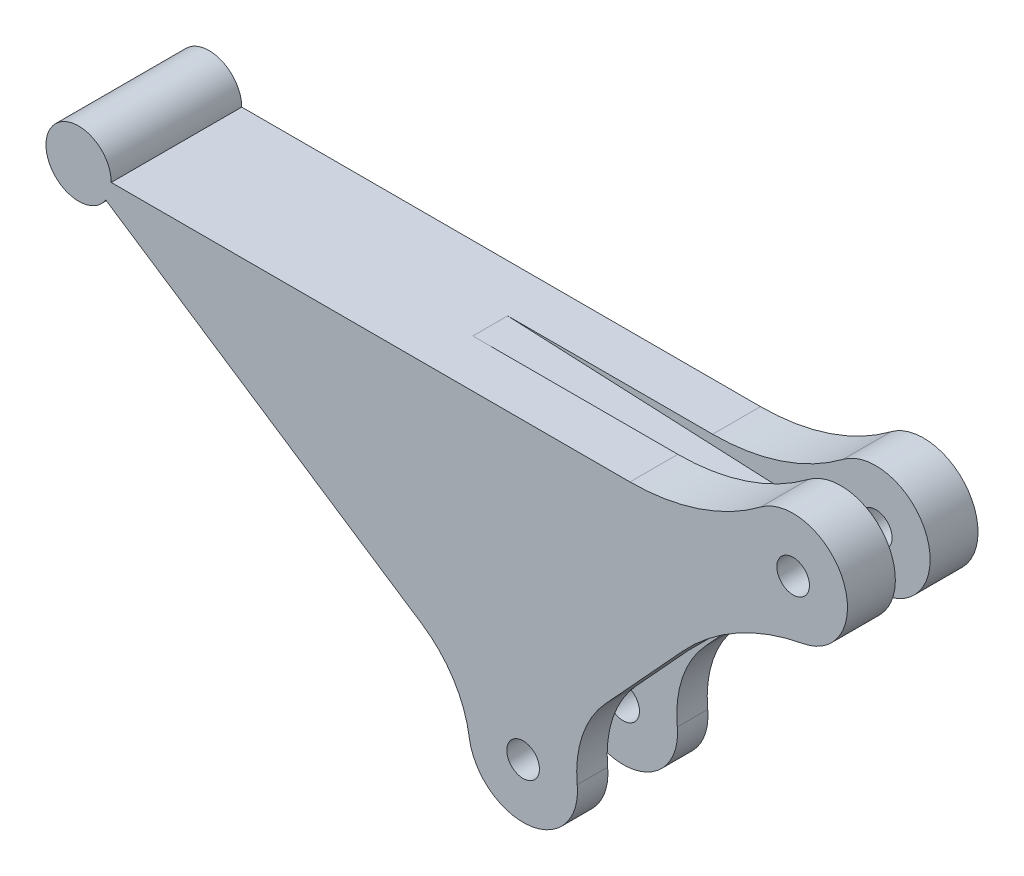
ISO-10303-21;
HEADER;
FILE_DESCRIPTION(('STEP AP214'),'2;1');
FILE_NAME('part.step','',(''),(''),'','','');
FILE_SCHEMA(('AUTOMOTIVE_DESIGN { 1 0 10303 214 1 1 1 1 }'));
ENDSEC;
DATA;
#1=APPLICATION_CONTEXT('core data for automotive mechanical design processes');
#2=APPLICATION_PROTOCOL_DEFINITION('international standard','automotive_design',2000,#1);
#3=PRODUCT_CONTEXT('',#1,'mechanical');
#4=PRODUCT('Part','Part','',(#3));
#5=PRODUCT_RELATED_PRODUCT_CATEGORY('part','',(#4));
#6=PRODUCT_DEFINITION_FORMATION('','',#4);
#7=PRODUCT_DEFINITION_CONTEXT('part definition',#1,'design');
#8=PRODUCT_DEFINITION('design','',#6,#7);
#9=PRODUCT_DEFINITION_SHAPE('','',#8);
#10=(LENGTH_UNIT() NAMED_UNIT(*) SI_UNIT(.MILLI.,.METRE.));
#11=(NAMED_UNIT(*) PLANE_ANGLE_UNIT() SI_UNIT($,.RADIAN.));
#12=(NAMED_UNIT(*) SI_UNIT($,.STERADIAN.) SOLID_ANGLE_UNIT());
#13=UNCERTAINTY_MEASURE_WITH_UNIT(LENGTH_MEASURE(1.E-05),#10,'distance_accuracy_value','');
#14=(GEOMETRIC_REPRESENTATION_CONTEXT(3) GLOBAL_UNCERTAINTY_ASSIGNED_CONTEXT((#13)) GLOBAL_UNIT_ASSIGNED_CONTEXT((#10,
#11,#12)) REPRESENTATION_CONTEXT('',''));
#15=CARTESIAN_POINT('',(0.,0.,0.));
#16=DIRECTION('',(0.,0.,1.));
#17=DIRECTION('',(1.,0.,0.));
#18=AXIS2_PLACEMENT_3D('',#15,#16,#17);
#19=CARTESIAN_POINT('',(-24.8278538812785,-27.0271654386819,12.));
#20=DIRECTION('',(0.,0.,-1.));
#21=DIRECTION('',(-1.,0.,0.));
#22=AXIS2_PLACEMENT_3D('',#19,#20,#21);
#23=CYLINDRICAL_SURFACE('',#22,5.);
#24=CARTESIAN_POINT('',(-24.8278538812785,-27.0271654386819,12.));
#25=DIRECTION('',(0.,0.,1.));
#26=DIRECTION('',(1.,0.,0.));
#27=AXIS2_PLACEMENT_3D('',#24,#25,#26);
#28=CIRCLE('',#27,5.);
#29=CARTESIAN_POINT('',(-29.7750385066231,-27.7519856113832,12.));
#30=VERTEX_POINT('',#29);
#31=CARTESIAN_POINT('',(-19.8518729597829,-26.5376617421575,12.));
#32=VERTEX_POINT('',#31);
#33=EDGE_CURVE('E285',#30,#32,#28,.T.);
#34=ORIENTED_EDGE('',*,*,#33,.F.);
#35=DIRECTION('',(0.,0.,-1.));
#36=VECTOR('',#35,1.);
#37=CARTESIAN_POINT('',(-29.7750385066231,-27.7519856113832,12.));
#38=LINE('',#37,#36);
#39=CARTESIAN_POINT('',(-29.7750385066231,-27.7519856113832,9.2));
#40=VERTEX_POINT('',#39);
#41=EDGE_CURVE('E370',#30,#40,#38,.T.);
#42=ORIENTED_EDGE('',*,*,#41,.T.);
#43=CARTESIAN_POINT('',(-24.8278538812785,-27.0271654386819,9.2));
#44=DIRECTION('',(0.,0.,-1.));
#45=DIRECTION('',(-1.,0.,0.));
#46=AXIS2_PLACEMENT_3D('',#43,#44,#45);
#47=CIRCLE('',#46,5.);
#48=CARTESIAN_POINT('',(-19.8518729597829,-26.5376617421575,9.2));
#49=VERTEX_POINT('',#48);
#50=EDGE_CURVE('E206',#49,#40,#47,.T.);
#51=ORIENTED_EDGE('',*,*,#50,.F.);
#52=DIRECTION('',(0.,0.,-1.));
#53=VECTOR('',#52,1.);
#54=CARTESIAN_POINT('',(-19.8518729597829,-26.5376617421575,12.));
#55=LINE('',#54,#53);
#56=EDGE_CURVE('E368',#49,#32,#55,.F.);
#57=ORIENTED_EDGE('',*,*,#56,.T.);
#58=EDGE_LOOP('',(#34,#42,#51,#57));
#59=FACE_BOUND('',#58,.T.);
#60=ADVANCED_FACE('F34',(#59),#23,.T.);
#61=CARTESIAN_POINT('',(0.,0.,12.));
#62=DIRECTION('',(0.736435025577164,-0.676508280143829,0.));
#63=DIRECTION('',(0.676508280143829,0.736435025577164,0.));
#64=AXIS2_PLACEMENT_3D('',#61,#62,#63);
#65=PLANE('',#64);
#66=DIRECTION('',(-0.676508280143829,-0.736435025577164,0.));
#67=VECTOR('',#66,1.);
#68=CARTESIAN_POINT('',(-12.4139269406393,-13.513582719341,2.8));
#69=LINE('',#68,#67);
#70=CARTESIAN_POINT('',(-12.4139269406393,-13.513582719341,2.8));
#71=VERTEX_POINT('',#70);
#72=CARTESIAN_POINT('',(-17.2642613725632,-18.7935715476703,2.8));
#73=VERTEX_POINT('',#72);
#74=EDGE_CURVE('E225',#71,#73,#69,.T.);
#75=ORIENTED_EDGE('',*,*,#74,.T.);
#76=DIRECTION('',(0.,0.,-1.));
#77=VECTOR('',#76,1.);
#78=CARTESIAN_POINT('',(-17.2642613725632,-18.7935715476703,12.));
#79=LINE('',#78,#77);
#80=CARTESIAN_POINT('',(-17.2642613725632,-18.7935715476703,0.));
#81=VERTEX_POINT('',#80);
#82=EDGE_CURVE('E373',#73,#81,#79,.T.);
#83=ORIENTED_EDGE('',*,*,#82,.T.);
#84=DIRECTION('',(-0.676508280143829,-0.736435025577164,0.));
#85=VECTOR('',#84,1.);
#86=CARTESIAN_POINT('',(0.,0.,0.));
#87=LINE('',#86,#85);
#88=CARTESIAN_POINT('',(-10.1476242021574,-11.0465253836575,0.));
#89=VERTEX_POINT('',#88);
#90=EDGE_CURVE('E308',#89,#81,#87,.T.);
#91=ORIENTED_EDGE('',*,*,#90,.F.);
#92=DIRECTION('',(0.,0.,-1.));
#93=VECTOR('',#92,1.);
#94=CARTESIAN_POINT('',(-10.1476242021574,-11.0465253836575,12.));
#95=LINE('',#94,#93);
#96=CARTESIAN_POINT('',(-10.1476242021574,-11.0465253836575,4.4));
#97=VERTEX_POINT('',#96);
#98=EDGE_CURVE('E339',#89,#97,#95,.F.);
#99=ORIENTED_EDGE('',*,*,#98,.T.);
#100=DIRECTION('',(-0.676508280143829,-0.736435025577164,0.));
#101=VECTOR('',#100,1.);
#102=CARTESIAN_POINT('',(-12.4139269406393,-13.513582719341,4.4));
#103=LINE('',#102,#101);
#104=CARTESIAN_POINT('',(-12.4139269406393,-13.513582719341,4.4));
#105=VERTEX_POINT('',#104);
#106=EDGE_CURVE('E261',#97,#105,#103,.T.);
#107=ORIENTED_EDGE('',*,*,#106,.T.);
#108=DIRECTION('',(0.,0.,1.));
#109=VECTOR('',#108,1.);
#110=CARTESIAN_POINT('',(-12.4139269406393,-13.513582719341,2.8));
#111=LINE('',#110,#109);
#112=EDGE_CURVE('E223',#71,#105,#111,.T.);
#113=ORIENTED_EDGE('',*,*,#112,.F.);
#114=EDGE_LOOP('',(#75,#83,#91,#99,#107,#113));
#115=FACE_BOUND('',#114,.T.);
#116=ADVANCED_FACE('F446',(#115),#65,.T.);
#117=DIRECTION('',(-0.676508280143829,-0.736435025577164,0.));
#118=VECTOR('',#117,1.);
#119=CARTESIAN_POINT('',(0.,0.,12.));
#120=LINE('',#119,#118);
#121=CARTESIAN_POINT('',(-10.1476242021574,-11.0465253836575,12.));
#122=VERTEX_POINT('',#121);
#123=CARTESIAN_POINT('',(-17.2642613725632,-18.7935715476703,12.));
#124=VERTEX_POINT('',#123);
#125=EDGE_CURVE('E287',#122,#124,#120,.T.);
#126=ORIENTED_EDGE('',*,*,#125,.T.);
#127=DIRECTION('',(0.,0.,-1.));
#128=VECTOR('',#127,1.);
#129=CARTESIAN_POINT('',(-17.2642613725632,-18.7935715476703,12.));
#130=LINE('',#129,#128);
#131=CARTESIAN_POINT('',(-17.2642613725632,-18.7935715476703,9.2));
#132=VERTEX_POINT('',#131);
#133=EDGE_CURVE('E376',#124,#132,#130,.T.);
#134=ORIENTED_EDGE('',*,*,#133,.T.);
#135=DIRECTION('',(-0.676508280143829,-0.736435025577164,0.));
#136=VECTOR('',#135,1.);
#137=CARTESIAN_POINT('',(-12.4139269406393,-13.513582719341,9.2));
#138=LINE('',#137,#136);
#139=CARTESIAN_POINT('',(-12.4139269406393,-13.513582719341,9.2));
#140=VERTEX_POINT('',#139);
#141=EDGE_CURVE('E391',#140,#132,#138,.T.);
#142=ORIENTED_EDGE('',*,*,#141,.F.);
#143=CARTESIAN_POINT('',(-12.4139269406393,-13.513582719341,7.6));
#144=VERTEX_POINT('',#143);
#145=EDGE_CURVE('E220',#144,#140,#111,.T.);
#146=ORIENTED_EDGE('',*,*,#145,.F.);
#147=DIRECTION('',(-0.676508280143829,-0.736435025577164,0.));
#148=VECTOR('',#147,1.);
#149=CARTESIAN_POINT('',(-12.4139269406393,-13.513582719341,7.6));
#150=LINE('',#149,#148);
#151=CARTESIAN_POINT('',(-10.1476242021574,-11.0465253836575,7.6));
#152=VERTEX_POINT('',#151);
#153=EDGE_CURVE('E245',#152,#144,#150,.T.);
#154=ORIENTED_EDGE('',*,*,#153,.F.);
#155=DIRECTION('',(0.,0.,-1.));
#156=VECTOR('',#155,1.);
#157=CARTESIAN_POINT('',(-10.1476242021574,-11.0465253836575,12.));
#158=LINE('',#157,#156);
#159=EDGE_CURVE('E341',#152,#122,#158,.F.);
#160=ORIENTED_EDGE('',*,*,#159,.T.);
#161=EDGE_LOOP('',(#126,#134,#142,#146,#154,#160));
#162=FACE_BOUND('',#161,.T.);
#163=ADVANCED_FACE('F397',(#162),#65,.T.);
#164=CARTESIAN_POINT('',(-24.8278538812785,-27.0271654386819,12.));
#165=DIRECTION('',(0.,0.,-1.));
#166=DIRECTION('',(-1.,0.,0.));
#167=AXIS2_PLACEMENT_3D('',#164,#165,#166);
#168=CYLINDRICAL_SURFACE('',#167,1.5);
#169=CARTESIAN_POINT('',(-24.8278538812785,-27.0271654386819,12.));
#170=DIRECTION('',(0.,0.,1.));
#171=DIRECTION('',(1.,0.,0.));
#172=AXIS2_PLACEMENT_3D('',#169,#170,#171);
#173=CIRCLE('',#172,1.5);
#174=CARTESIAN_POINT('',(-23.3278538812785,-27.0271654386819,12.));
#175=VERTEX_POINT('',#174);
#176=EDGE_CURVE('E271',#175,#175,#173,.T.);
#177=ORIENTED_EDGE('',*,*,#176,.T.);
#178=EDGE_LOOP('',(#177));
#179=FACE_BOUND('',#178,.T.);
#180=CARTESIAN_POINT('',(-24.8278538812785,-27.0271654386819,9.2));
#181=DIRECTION('',(0.,0.,-1.));
#182=DIRECTION('',(-1.,0.,0.));
#183=AXIS2_PLACEMENT_3D('',#180,#181,#182);
#184=CIRCLE('',#183,1.5);
#185=CARTESIAN_POINT('',(-26.3278538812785,-27.0271654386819,9.2));
#186=VERTEX_POINT('',#185);
#187=EDGE_CURVE('E319',#186,#186,#184,.T.);
#188=ORIENTED_EDGE('',*,*,#187,.T.);
#189=EDGE_LOOP('',(#188));
#190=FACE_BOUND('',#189,.T.);
#191=ADVANCED_FACE('F465',(#179,#190),#168,.F.);
#192=CARTESIAN_POINT('',(0.,0.,12.));
#193=DIRECTION('',(0.,0.,-1.));
#194=DIRECTION('',(-1.,0.,0.));
#195=AXIS2_PLACEMENT_3D('',#192,#193,#194);
#196=CYLINDRICAL_SURFACE('',#195,5.);
#197=CARTESIAN_POINT('',(0.,0.,7.6));
#198=DIRECTION('',(0.,0.,-1.));
#199=DIRECTION('',(-1.,0.,0.));
#200=AXIS2_PLACEMENT_3D('',#197,#198,#199);
#201=CIRCLE('',#200,5.);
#202=CARTESIAN_POINT('',(-3.,4.,7.6));
#203=VERTEX_POINT('',#202);
#204=CARTESIAN_POINT('',(0.916215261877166,-4.91533819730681,7.6));
#205=VERTEX_POINT('',#204);
#206=EDGE_CURVE('E242',#203,#205,#201,.T.);
#207=ORIENTED_EDGE('',*,*,#206,.F.);
#208=DIRECTION('',(0.,0.,-1.));
#209=VECTOR('',#208,1.);
#210=CARTESIAN_POINT('',(-3.,4.,12.));
#211=LINE('',#210,#209);
#212=CARTESIAN_POINT('',(-3.,4.,12.));
#213=VERTEX_POINT('',#212);
#214=EDGE_CURVE('E337',#203,#213,#211,.F.);
#215=ORIENTED_EDGE('',*,*,#214,.T.);
#216=CARTESIAN_POINT('',(0.,0.,12.));
#217=DIRECTION('',(0.,0.,1.));
#218=DIRECTION('',(1.,0.,0.));
#219=AXIS2_PLACEMENT_3D('',#216,#217,#218);
#220=CIRCLE('',#219,5.);
#221=CARTESIAN_POINT('',(0.916215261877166,-4.91533819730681,12.));
#222=VERTEX_POINT('',#221);
#223=EDGE_CURVE('E274',#222,#213,#220,.T.);
#224=ORIENTED_EDGE('',*,*,#223,.F.);
#225=DIRECTION('',(0.,0.,-1.));
#226=VECTOR('',#225,1.);
#227=CARTESIAN_POINT('',(0.916215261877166,-4.91533819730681,12.));
#228=LINE('',#227,#226);
#229=EDGE_CURVE('E334',#222,#205,#228,.T.);
#230=ORIENTED_EDGE('',*,*,#229,.T.);
#231=EDGE_LOOP('',(#207,#215,#224,#230));
#232=FACE_BOUND('',#231,.T.);
#233=ADVANCED_FACE('F410',(#232),#196,.T.);
#234=CARTESIAN_POINT('',(0.,0.,12.));
#235=DIRECTION('',(0.,0.,-1.));
#236=DIRECTION('',(-1.,0.,0.));
#237=AXIS2_PLACEMENT_3D('',#234,#235,#236);
#238=CYLINDRICAL_SURFACE('',#237,1.5);
#239=CARTESIAN_POINT('',(0.,0.,12.));
#240=DIRECTION('',(0.,0.,1.));
#241=DIRECTION('',(1.,0.,0.));
#242=AXIS2_PLACEMENT_3D('',#239,#240,#241);
#243=CIRCLE('',#242,1.5);
#244=CARTESIAN_POINT('',(1.5,0.,12.));
#245=VERTEX_POINT('',#244);
#246=EDGE_CURVE('E289',#245,#245,#243,.T.);
#247=ORIENTED_EDGE('',*,*,#246,.T.);
#248=EDGE_LOOP('',(#247));
#249=FACE_BOUND('',#248,.T.);
#250=CARTESIAN_POINT('',(0.,0.,7.6));
#251=DIRECTION('',(0.,0.,-1.));
#252=DIRECTION('',(-1.,0.,0.));
#253=AXIS2_PLACEMENT_3D('',#250,#251,#252);
#254=CIRCLE('',#253,1.5);
#255=CARTESIAN_POINT('',(-1.5,0.,7.6));
#256=VERTEX_POINT('',#255);
#257=EDGE_CURVE('E229',#256,#256,#254,.T.);
#258=ORIENTED_EDGE('',*,*,#257,.T.);
#259=EDGE_LOOP('',(#258));
#260=FACE_BOUND('',#259,.T.);
#261=ADVANCED_FACE('F538',(#249,#260),#238,.F.);
#262=CARTESIAN_POINT('',(0.,0.,0.));
#263=DIRECTION('',(0.,0.,1.));
#264=DIRECTION('',(1.,0.,0.));
#265=AXIS2_PLACEMENT_3D('',#262,#263,#264);
#266=CIRCLE('',#265,5.);
#267=CARTESIAN_POINT('',(0.916215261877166,-4.91533819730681,0.));
#268=VERTEX_POINT('',#267);
#269=CARTESIAN_POINT('',(-3.,4.,0.));
#270=VERTEX_POINT('',#269);
#271=EDGE_CURVE('E295',#268,#270,#266,.T.);
#272=ORIENTED_EDGE('',*,*,#271,.T.);
#273=DIRECTION('',(0.,0.,-1.));
#274=VECTOR('',#273,1.);
#275=CARTESIAN_POINT('',(-3.,4.,12.));
#276=LINE('',#275,#274);
#277=CARTESIAN_POINT('',(-3.,4.,4.4));
#278=VERTEX_POINT('',#277);
#279=EDGE_CURVE('E332',#270,#278,#276,.F.);
#280=ORIENTED_EDGE('',*,*,#279,.T.);
#281=CARTESIAN_POINT('',(0.,0.,4.4));
#282=DIRECTION('',(0.,0.,-1.));
#283=DIRECTION('',(-1.,0.,0.));
#284=AXIS2_PLACEMENT_3D('',#281,#282,#283);
#285=CIRCLE('',#284,5.);
#286=CARTESIAN_POINT('',(0.916215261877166,-4.91533819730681,4.4));
#287=VERTEX_POINT('',#286);
#288=EDGE_CURVE('E258',#278,#287,#285,.T.);
#289=ORIENTED_EDGE('',*,*,#288,.T.);
#290=DIRECTION('',(0.,0.,-1.));
#291=VECTOR('',#290,1.);
#292=CARTESIAN_POINT('',(0.916215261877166,-4.91533819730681,12.));
#293=LINE('',#292,#291);
#294=EDGE_CURVE('E329',#287,#268,#293,.T.);
#295=ORIENTED_EDGE('',*,*,#294,.T.);
#296=EDGE_LOOP('',(#272,#280,#289,#295));
#297=FACE_BOUND('',#296,.T.);
#298=ADVANCED_FACE('F519',(#297),#196,.T.);
#299=CARTESIAN_POINT('',(0.,0.,12.));
#300=DIRECTION('',(0.,-1.,0.));
#301=DIRECTION('',(1.,0.,0.));
#302=AXIS2_PLACEMENT_3D('',#299,#300,#301);
#303=PLANE('',#302);
#304=DIRECTION('',(1.,0.,0.));
#305=VECTOR('',#304,1.);
#306=CARTESIAN_POINT('',(-5.,0.,4.4));
#307=LINE('',#306,#305);
#308=CARTESIAN_POINT('',(-33.85,0.,4.4));
#309=VERTEX_POINT('',#308);
#310=CARTESIAN_POINT('',(-15.,0.,4.4));
#311=VERTEX_POINT('',#310);
#312=EDGE_CURVE('E255',#309,#311,#307,.T.);
#313=ORIENTED_EDGE('',*,*,#312,.T.);
#314=DIRECTION('',(0.,0.,1.));
#315=VECTOR('',#314,1.);
#316=CARTESIAN_POINT('',(-15.,0.,0.));
#317=LINE('',#316,#315);
#318=CARTESIAN_POINT('',(-15.,0.,0.));
#319=VERTEX_POINT('',#318);
#320=EDGE_CURVE('E326',#311,#319,#317,.F.);
#321=ORIENTED_EDGE('',*,*,#320,.T.);
#322=DIRECTION('',(-1.,0.,0.));
#323=VECTOR('',#322,1.);
#324=CARTESIAN_POINT('',(0.,0.,0.));
#325=LINE('',#324,#323);
#326=CARTESIAN_POINT('',(-62.7,0.,0.));
#327=VERTEX_POINT('',#326);
#328=EDGE_CURVE('E298',#319,#327,#325,.T.);
#329=ORIENTED_EDGE('',*,*,#328,.T.);
#330=DIRECTION('',(0.,0.,-1.));
#331=VECTOR('',#330,1.);
#332=CARTESIAN_POINT('',(-62.7,0.,12.));
#333=LINE('',#332,#331);
#334=CARTESIAN_POINT('',(-62.7,0.,12.));
#335=VERTEX_POINT('',#334);
#336=EDGE_CURVE('E315',#335,#327,#333,.T.);
#337=ORIENTED_EDGE('',*,*,#336,.F.);
#338=DIRECTION('',(-1.,0.,0.));
#339=VECTOR('',#338,1.);
#340=CARTESIAN_POINT('',(0.,0.,12.));
#341=LINE('',#340,#339);
#342=CARTESIAN_POINT('',(-15.,0.,12.));
#343=VERTEX_POINT('',#342);
#344=EDGE_CURVE('E278',#343,#335,#341,.T.);
#345=ORIENTED_EDGE('',*,*,#344,.F.);
#346=DIRECTION('',(0.,0.,1.));
#347=VECTOR('',#346,1.);
#348=CARTESIAN_POINT('',(-15.,0.,7.6));
#349=LINE('',#348,#347);
#350=CARTESIAN_POINT('',(-15.,0.,7.6));
#351=VERTEX_POINT('',#350);
#352=EDGE_CURVE('E318',#343,#351,#349,.F.);
#353=ORIENTED_EDGE('',*,*,#352,.T.);
#354=DIRECTION('',(1.,0.,0.));
#355=VECTOR('',#354,1.);
#356=CARTESIAN_POINT('',(-5.,0.,7.6));
#357=LINE('',#356,#355);
#358=CARTESIAN_POINT('',(-33.85,0.,7.6));
#359=VERTEX_POINT('',#358);
#360=EDGE_CURVE('E239',#359,#351,#357,.T.);
#361=ORIENTED_EDGE('',*,*,#360,.F.);
#362=DIRECTION('',(0.,0.,1.));
#363=VECTOR('',#362,1.);
#364=CARTESIAN_POINT('',(-33.85,0.,4.4));
#365=LINE('',#364,#363);
#366=EDGE_CURVE('E266',#309,#359,#365,.T.);
#367=ORIENTED_EDGE('',*,*,#366,.F.);
#368=EDGE_LOOP('',(#313,#321,#329,#337,#345,#353,#361,#367));
#369=FACE_BOUND('',#368,.T.);
#370=ADVANCED_FACE('F421',(#369),#303,.F.);
#371=CARTESIAN_POINT('',(-65.7,0.,12.));
#372=DIRECTION('',(0.,0.,-1.));
#373=DIRECTION('',(-1.,0.,0.));
#374=AXIS2_PLACEMENT_3D('',#371,#372,#373);
#375=CYLINDRICAL_SURFACE('',#374,3.00000000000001);
#376=CARTESIAN_POINT('',(-65.7,0.,0.));
#377=DIRECTION('',(0.,0.,1.));
#378=DIRECTION('',(1.,0.,0.));
#379=AXIS2_PLACEMENT_3D('',#376,#377,#378);
#380=CIRCLE('',#379,3.00000000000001);
#381=CARTESIAN_POINT('',(-63.1976237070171,-1.65472441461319,0.));
#382=VERTEX_POINT('',#381);
#383=EDGE_CURVE('E300',#327,#382,#380,.T.);
#384=ORIENTED_EDGE('',*,*,#383,.T.);
#385=DIRECTION('',(0.,0.,-1.));
#386=VECTOR('',#385,1.);
#387=CARTESIAN_POINT('',(-63.1976237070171,-1.65472441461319,12.));
#388=LINE('',#387,#386);
#389=CARTESIAN_POINT('',(-63.1976237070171,-1.65472441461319,12.));
#390=VERTEX_POINT('',#389);
#391=EDGE_CURVE('E292',#390,#382,#388,.T.);
#392=ORIENTED_EDGE('',*,*,#391,.F.);
#393=CARTESIAN_POINT('',(-65.7,0.,12.));
#394=DIRECTION('',(0.,0.,1.));
#395=DIRECTION('',(1.,0.,0.));
#396=AXIS2_PLACEMENT_3D('',#393,#394,#395);
#397=CIRCLE('',#396,3.00000000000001);
#398=EDGE_CURVE('E280',#335,#390,#397,.T.);
#399=ORIENTED_EDGE('',*,*,#398,.F.);
#400=ORIENTED_EDGE('',*,*,#336,.T.);
#401=EDGE_LOOP('',(#384,#392,#399,#400));
#402=FACE_BOUND('',#401,.T.);
#403=ADVANCED_FACE('F429',(#402),#375,.T.);
#404=CARTESIAN_POINT('',(-19.9882240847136,-30.2274249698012,12.));
#405=DIRECTION('',(-0.551574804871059,-0.834125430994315,0.));
#406=DIRECTION('',(0.834125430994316,-0.55157480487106,0.));
#407=AXIS2_PLACEMENT_3D('',#404,#405,#406);
#408=PLANE('',#407);
#409=DIRECTION('',(-0.834125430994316,0.55157480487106,0.));
#410=VECTOR('',#409,1.);
#411=CARTESIAN_POINT('',(-19.9882240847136,-30.2274249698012,0.));
#412=LINE('',#411,#410);
#413=CARTESIAN_POINT('',(-34.1536597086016,-20.8603716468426,0.));
#414=VERTEX_POINT('',#413);
#415=EDGE_CURVE('E303',#414,#382,#412,.T.);
#416=ORIENTED_EDGE('',*,*,#415,.F.);
#417=DIRECTION('',(0.,0.,-1.));
#418=VECTOR('',#417,1.);
#419=CARTESIAN_POINT('',(-34.1536597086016,-20.8603716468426,12.));
#420=LINE('',#419,#418);
#421=CARTESIAN_POINT('',(-34.1536597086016,-20.8603716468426,2.8));
#422=VERTEX_POINT('',#421);
#423=EDGE_CURVE('E366',#414,#422,#420,.F.);
#424=ORIENTED_EDGE('',*,*,#423,.T.);
#425=DIRECTION('',(-0.834125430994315,0.55157480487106,0.));
#426=VECTOR('',#425,1.);
#427=CARTESIAN_POINT('',(-28.9984810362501,-24.2692914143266,2.8));
#428=LINE('',#427,#426);
#429=CARTESIAN_POINT('',(-46.0980523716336,-12.9620079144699,2.8));
#430=VERTEX_POINT('',#429);
#431=EDGE_CURVE('E219',#422,#430,#428,.T.);
#432=ORIENTED_EDGE('',*,*,#431,.T.);
#433=DIRECTION('',(0.,0.,1.));
#434=VECTOR('',#433,1.);
#435=CARTESIAN_POINT('',(-46.0980523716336,-12.9620079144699,2.8));
#436=LINE('',#435,#434);
#437=CARTESIAN_POINT('',(-46.0980523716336,-12.9620079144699,9.2));
#438=VERTEX_POINT('',#437);
#439=EDGE_CURVE('E212',#430,#438,#436,.T.);
#440=ORIENTED_EDGE('',*,*,#439,.T.);
#441=DIRECTION('',(-0.834125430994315,0.55157480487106,0.));
#442=VECTOR('',#441,1.);
#443=CARTESIAN_POINT('',(-28.9984810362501,-24.2692914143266,9.2));
#444=LINE('',#443,#442);
#445=CARTESIAN_POINT('',(-34.1536597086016,-20.8603716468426,9.2));
#446=VERTEX_POINT('',#445);
#447=EDGE_CURVE('E195',#446,#438,#444,.T.);
#448=ORIENTED_EDGE('',*,*,#447,.F.);
#449=DIRECTION('',(0.,0.,-1.));
#450=VECTOR('',#449,1.);
#451=CARTESIAN_POINT('',(-34.1536597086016,-20.8603716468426,12.));
#452=LINE('',#451,#450);
#453=CARTESIAN_POINT('',(-34.1536597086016,-20.8603716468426,12.));
#454=VERTEX_POINT('',#453);
#455=EDGE_CURVE('E364',#446,#454,#452,.F.);
#456=ORIENTED_EDGE('',*,*,#455,.T.);
#457=DIRECTION('',(-0.834125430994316,0.55157480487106,0.));
#458=VECTOR('',#457,1.);
#459=CARTESIAN_POINT('',(-19.9882240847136,-30.2274249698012,12.));
#460=LINE('',#459,#458);
#461=EDGE_CURVE('E283',#454,#390,#460,.T.);
#462=ORIENTED_EDGE('',*,*,#461,.T.);
#463=ORIENTED_EDGE('',*,*,#391,.T.);
#464=EDGE_LOOP('',(#416,#424,#432,#440,#448,#456,#462,#463));
#465=FACE_BOUND('',#464,.T.);
#466=ADVANCED_FACE('F217',(#465),#408,.T.);
#467=CARTESIAN_POINT('',(-24.8278538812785,-27.0271654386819,2.8));
#468=DIRECTION('',(0.,0.,-1.));
#469=DIRECTION('',(-1.,0.,0.));
#470=AXIS2_PLACEMENT_3D('',#467,#468,#469);
#471=CIRCLE('',#470,5.);
#472=CARTESIAN_POINT('',(-19.8518729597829,-26.5376617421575,2.8));
#473=VERTEX_POINT('',#472);
#474=CARTESIAN_POINT('',(-29.7750385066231,-27.7519856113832,2.8));
#475=VERTEX_POINT('',#474);
#476=EDGE_CURVE('E468',#473,#475,#471,.T.);
#477=ORIENTED_EDGE('',*,*,#476,.T.);
#478=DIRECTION('',(0.,0.,-1.));
#479=VECTOR('',#478,1.);
#480=CARTESIAN_POINT('',(-29.7750385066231,-27.7519856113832,12.));
#481=LINE('',#480,#479);
#482=CARTESIAN_POINT('',(-29.7750385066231,-27.7519856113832,0.));
#483=VERTEX_POINT('',#482);
#484=EDGE_CURVE('E361',#475,#483,#481,.T.);
#485=ORIENTED_EDGE('',*,*,#484,.T.);
#486=CARTESIAN_POINT('',(-24.8278538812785,-27.0271654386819,0.));
#487=DIRECTION('',(0.,0.,1.));
#488=DIRECTION('',(1.,0.,0.));
#489=AXIS2_PLACEMENT_3D('',#486,#487,#488);
#490=CIRCLE('',#489,5.);
#491=CARTESIAN_POINT('',(-19.8518729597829,-26.5376617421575,0.));
#492=VERTEX_POINT('',#491);
#493=EDGE_CURVE('E305',#483,#492,#490,.T.);
#494=ORIENTED_EDGE('',*,*,#493,.T.);
#495=DIRECTION('',(0.,0.,-1.));
#496=VECTOR('',#495,1.);
#497=CARTESIAN_POINT('',(-19.8518729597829,-26.5376617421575,12.));
#498=LINE('',#497,#496);
#499=EDGE_CURVE('E359',#492,#473,#498,.F.);
#500=ORIENTED_EDGE('',*,*,#499,.T.);
#501=EDGE_LOOP('',(#477,#485,#494,#500));
#502=FACE_BOUND('',#501,.T.);
#503=ADVANCED_FACE('F448',(#502),#23,.T.);
#504=CARTESIAN_POINT('',(-24.8278538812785,-27.0271654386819,2.8));
#505=DIRECTION('',(0.,0.,-1.));
#506=DIRECTION('',(-1.,0.,0.));
#507=AXIS2_PLACEMENT_3D('',#504,#505,#506);
#508=CIRCLE('',#507,1.5);
#509=CARTESIAN_POINT('',(-26.3278538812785,-27.0271654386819,2.8));
#510=VERTEX_POINT('',#509);
#511=EDGE_CURVE('E233',#510,#510,#508,.T.);
#512=ORIENTED_EDGE('',*,*,#511,.F.);
#513=EDGE_LOOP('',(#512));
#514=FACE_BOUND('',#513,.T.);
#515=CARTESIAN_POINT('',(-24.8278538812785,-27.0271654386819,0.));
#516=DIRECTION('',(0.,0.,1.));
#517=DIRECTION('',(1.,0.,0.));
#518=AXIS2_PLACEMENT_3D('',#515,#516,#517);
#519=CIRCLE('',#518,1.5);
#520=CARTESIAN_POINT('',(-23.3278538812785,-27.0271654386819,0.));
#521=VERTEX_POINT('',#520);
#522=EDGE_CURVE('E270',#521,#521,#519,.T.);
#523=ORIENTED_EDGE('',*,*,#522,.F.);
#524=EDGE_LOOP('',(#523));
#525=FACE_BOUND('',#524,.T.);
#526=ADVANCED_FACE('F456',(#514,#525),#168,.F.);
#527=CARTESIAN_POINT('',(0.,0.,4.4));
#528=DIRECTION('',(0.,0.,-1.));
#529=DIRECTION('',(-1.,0.,0.));
#530=AXIS2_PLACEMENT_3D('',#527,#528,#529);
#531=CIRCLE('',#530,1.5);
#532=CARTESIAN_POINT('',(-1.5,0.,4.4));
#533=VERTEX_POINT('',#532);
#534=EDGE_CURVE('E247',#533,#533,#531,.T.);
#535=ORIENTED_EDGE('',*,*,#534,.F.);
#536=EDGE_LOOP('',(#535));
#537=FACE_BOUND('',#536,.T.);
#538=CARTESIAN_POINT('',(0.,0.,0.));
#539=DIRECTION('',(0.,0.,1.));
#540=DIRECTION('',(1.,0.,0.));
#541=AXIS2_PLACEMENT_3D('',#538,#539,#540);
#542=CIRCLE('',#541,1.5);
#543=CARTESIAN_POINT('',(1.5,0.,0.));
#544=VERTEX_POINT('',#543);
#545=EDGE_CURVE('E275',#544,#544,#542,.T.);
#546=ORIENTED_EDGE('',*,*,#545,.F.);
#547=EDGE_LOOP('',(#546));
#548=FACE_BOUND('',#547,.T.);
#549=ADVANCED_FACE('F462',(#537,#548),#238,.F.);
#550=CARTESIAN_POINT('',(0.,0.,12.));
#551=DIRECTION('',(0.,0.,1.));
#552=DIRECTION('',(1.,0.,0.));
#553=AXIS2_PLACEMENT_3D('',#550,#551,#552);
#554=PLANE('',#553);
#555=ORIENTED_EDGE('',*,*,#176,.F.);
#556=EDGE_LOOP('',(#555));
#557=FACE_BOUND('',#556,.T.);
#558=ORIENTED_EDGE('',*,*,#125,.F.);
#559=CARTESIAN_POINT('',(4.58107630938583,-24.576690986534,12.));
#560=DIRECTION('',(0.,0.,1.));
#561=DIRECTION('',(1.,0.,0.));
#562=AXIS2_PLACEMENT_3D('',#559,#560,#561);
#563=CIRCLE('',#562,20.);
#564=EDGE_CURVE('E357',#122,#222,#563,.F.);
#565=ORIENTED_EDGE('',*,*,#564,.T.);
#566=ORIENTED_EDGE('',*,*,#223,.T.);
#567=CARTESIAN_POINT('',(-15.,20.,12.));
#568=DIRECTION('',(0.,0.,1.));
#569=DIRECTION('',(1.,0.,0.));
#570=AXIS2_PLACEMENT_3D('',#567,#568,#569);
#571=CIRCLE('',#570,20.);
#572=EDGE_CURVE('E349',#213,#343,#571,.F.);
#573=ORIENTED_EDGE('',*,*,#572,.T.);
#574=ORIENTED_EDGE('',*,*,#344,.T.);
#575=ORIENTED_EDGE('',*,*,#398,.T.);
#576=ORIENTED_EDGE('',*,*,#461,.F.);
#577=CARTESIAN_POINT('',(-39.6694077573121,-29.2016259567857,12.));
#578=DIRECTION('',(0.,0.,1.));
#579=DIRECTION('',(1.,0.,0.));
#580=AXIS2_PLACEMENT_3D('',#577,#578,#579);
#581=CIRCLE('',#580,10.);
#582=EDGE_CURVE('E383',#454,#30,#581,.F.);
#583=ORIENTED_EDGE('',*,*,#582,.T.);
#584=ORIENTED_EDGE('',*,*,#33,.T.);
#585=CARTESIAN_POINT('',(-9.89991111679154,-25.5586543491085,12.));
#586=DIRECTION('',(0.,0.,1.));
#587=DIRECTION('',(1.,0.,0.));
#588=AXIS2_PLACEMENT_3D('',#585,#586,#587);
#589=CIRCLE('',#588,10.);
#590=EDGE_CURVE('E11',#32,#124,#589,.F.);
#591=ORIENTED_EDGE('',*,*,#590,.T.);
#592=EDGE_LOOP('',(#558,#565,#566,#573,#574,#575,#576,#583,#584,#591));
#593=FACE_BOUND('',#592,.T.);
#594=ORIENTED_EDGE('',*,*,#246,.F.);
#595=EDGE_LOOP('',(#594));
#596=FACE_BOUND('',#595,.T.);
#597=ADVANCED_FACE('F402',(#557,#593,#596),#554,.T.);
#598=CARTESIAN_POINT('',(0.,0.,0.));
#599=DIRECTION('',(0.,0.,1.));
#600=DIRECTION('',(1.,0.,0.));
#601=AXIS2_PLACEMENT_3D('',#598,#599,#600);
#602=PLANE('',#601);
#603=ORIENTED_EDGE('',*,*,#522,.T.);
#604=EDGE_LOOP('',(#603));
#605=FACE_BOUND('',#604,.T.);
#606=ORIENTED_EDGE('',*,*,#271,.F.);
#607=CARTESIAN_POINT('',(4.58107630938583,-24.576690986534,0.));
#608=DIRECTION('',(0.,0.,1.));
#609=DIRECTION('',(1.,0.,0.));
#610=AXIS2_PLACEMENT_3D('',#607,#608,#609);
#611=CIRCLE('',#610,20.);
#612=EDGE_CURVE('E351',#268,#89,#611,.T.);
#613=ORIENTED_EDGE('',*,*,#612,.T.);
#614=ORIENTED_EDGE('',*,*,#90,.T.);
#615=CARTESIAN_POINT('',(-9.89991111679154,-25.5586543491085,0.));
#616=DIRECTION('',(0.,0.,1.));
#617=DIRECTION('',(1.,0.,0.));
#618=AXIS2_PLACEMENT_3D('',#615,#616,#617);
#619=CIRCLE('',#618,10.);
#620=EDGE_CURVE('E385',#81,#492,#619,.T.);
#621=ORIENTED_EDGE('',*,*,#620,.T.);
#622=ORIENTED_EDGE('',*,*,#493,.F.);
#623=CARTESIAN_POINT('',(-39.6694077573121,-29.2016259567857,0.));
#624=DIRECTION('',(0.,0.,1.));
#625=DIRECTION('',(1.,0.,0.));
#626=AXIS2_PLACEMENT_3D('',#623,#624,#625);
#627=CIRCLE('',#626,10.);
#628=EDGE_CURVE('E378',#483,#414,#627,.T.);
#629=ORIENTED_EDGE('',*,*,#628,.T.);
#630=ORIENTED_EDGE('',*,*,#415,.T.);
#631=ORIENTED_EDGE('',*,*,#383,.F.);
#632=ORIENTED_EDGE('',*,*,#328,.F.);
#633=CARTESIAN_POINT('',(-15.,20.,0.));
#634=DIRECTION('',(0.,0.,1.));
#635=DIRECTION('',(1.,0.,0.));
#636=AXIS2_PLACEMENT_3D('',#633,#634,#635);
#637=CIRCLE('',#636,20.);
#638=EDGE_CURVE('E343',#319,#270,#637,.T.);
#639=ORIENTED_EDGE('',*,*,#638,.T.);
#640=EDGE_LOOP('',(#606,#613,#614,#621,#622,#629,#630,#631,#632,#639));
#641=FACE_BOUND('',#640,.T.);
#642=ORIENTED_EDGE('',*,*,#545,.T.);
#643=EDGE_LOOP('',(#642));
#644=FACE_BOUND('',#643,.T.);
#645=ADVANCED_FACE('F478',(#605,#641,#644),#602,.F.);
#646=CARTESIAN_POINT('',(0.,0.,4.4));
#647=DIRECTION('',(0.,0.,-1.));
#648=DIRECTION('',(-1.,0.,0.));
#649=AXIS2_PLACEMENT_3D('',#646,#647,#648);
#650=PLANE('',#649);
#651=DIRECTION('',(0.530023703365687,0.847982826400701,0.));
#652=VECTOR('',#651,1.);
#653=CARTESIAN_POINT('',(-4.8133382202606,-1.35343089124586,4.4));
#654=LINE('',#653,#652);
#655=CARTESIAN_POINT('',(-4.8133382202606,-1.35343089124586,4.4));
#656=VERTEX_POINT('',#655);
#657=EDGE_CURVE('E250',#105,#656,#654,.T.);
#658=ORIENTED_EDGE('',*,*,#657,.F.);
#659=ORIENTED_EDGE('',*,*,#106,.F.);
#660=CARTESIAN_POINT('',(4.58107630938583,-24.576690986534,4.4));
#661=DIRECTION('',(0.,0.,-1.));
#662=DIRECTION('',(-1.,0.,0.));
#663=AXIS2_PLACEMENT_3D('',#660,#661,#662);
#664=CIRCLE('',#663,20.);
#665=EDGE_CURVE('E353',#97,#287,#664,.T.);
#666=ORIENTED_EDGE('',*,*,#665,.T.);
#667=ORIENTED_EDGE('',*,*,#288,.F.);
#668=CARTESIAN_POINT('',(-15.,20.,4.4));
#669=DIRECTION('',(0.,0.,-1.));
#670=DIRECTION('',(-1.,0.,0.));
#671=AXIS2_PLACEMENT_3D('',#668,#669,#670);
#672=CIRCLE('',#671,20.);
#673=EDGE_CURVE('E345',#278,#311,#672,.T.);
#674=ORIENTED_EDGE('',*,*,#673,.T.);
#675=ORIENTED_EDGE('',*,*,#312,.F.);
#676=DIRECTION('',(-0.998915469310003,0.0465605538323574,0.));
#677=VECTOR('',#676,1.);
#678=CARTESIAN_POINT('',(-4.8133382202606,-1.35343089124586,4.4));
#679=LINE('',#678,#677);
#680=EDGE_CURVE('E253',#656,#309,#679,.T.);
#681=ORIENTED_EDGE('',*,*,#680,.F.);
#682=EDGE_LOOP('',(#658,#659,#666,#667,#674,#675,#681));
#683=FACE_BOUND('',#682,.T.);
#684=ORIENTED_EDGE('',*,*,#534,.T.);
#685=EDGE_LOOP('',(#684));
#686=FACE_BOUND('',#685,.T.);
#687=ADVANCED_FACE('F500',(#683,#686),#650,.F.);
#688=CARTESIAN_POINT('',(-4.8133382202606,-1.35343089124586,4.4));
#689=DIRECTION('',(0.847982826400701,-0.530023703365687,0.));
#690=DIRECTION('',(0.530023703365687,0.847982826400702,0.));
#691=AXIS2_PLACEMENT_3D('',#688,#689,#690);
#692=PLANE('',#691);
#693=DIRECTION('',(0.,0.,1.));
#694=VECTOR('',#693,1.);
#695=CARTESIAN_POINT('',(-12.4139269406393,-13.513582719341,4.4));
#696=LINE('',#695,#694);
#697=EDGE_CURVE('E263',#105,#144,#696,.T.);
#698=ORIENTED_EDGE('',*,*,#697,.F.);
#699=ORIENTED_EDGE('',*,*,#657,.T.);
#700=DIRECTION('',(0.,0.,1.));
#701=VECTOR('',#700,1.);
#702=CARTESIAN_POINT('',(-4.8133382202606,-1.35343089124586,4.4));
#703=LINE('',#702,#701);
#704=CARTESIAN_POINT('',(-4.8133382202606,-1.35343089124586,7.6));
#705=VERTEX_POINT('',#704);
#706=EDGE_CURVE('E268',#656,#705,#703,.T.);
#707=ORIENTED_EDGE('',*,*,#706,.T.);
#708=DIRECTION('',(0.530023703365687,0.847982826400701,0.));
#709=VECTOR('',#708,1.);
#710=CARTESIAN_POINT('',(-4.8133382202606,-1.35343089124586,7.6));
#711=LINE('',#710,#709);
#712=EDGE_CURVE('E232',#144,#705,#711,.T.);
#713=ORIENTED_EDGE('',*,*,#712,.F.);
#714=EDGE_LOOP('',(#698,#699,#707,#713));
#715=FACE_BOUND('',#714,.T.);
#716=ADVANCED_FACE('F496',(#715),#692,.T.);
#717=CARTESIAN_POINT('',(-4.8133382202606,-1.35343089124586,4.4));
#718=DIRECTION('',(0.0465605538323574,0.998915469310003,0.));
#719=DIRECTION('',(-0.998915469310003,0.0465605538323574,0.));
#720=AXIS2_PLACEMENT_3D('',#717,#718,#719);
#721=PLANE('',#720);
#722=ORIENTED_EDGE('',*,*,#706,.F.);
#723=ORIENTED_EDGE('',*,*,#680,.T.);
#724=ORIENTED_EDGE('',*,*,#366,.T.);
#725=DIRECTION('',(-0.998915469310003,0.0465605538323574,0.));
#726=VECTOR('',#725,1.);
#727=CARTESIAN_POINT('',(-4.8133382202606,-1.35343089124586,7.6));
#728=LINE('',#727,#726);
#729=EDGE_CURVE('E236',#705,#359,#728,.T.);
#730=ORIENTED_EDGE('',*,*,#729,.F.);
#731=EDGE_LOOP('',(#722,#723,#724,#730));
#732=FACE_BOUND('',#731,.T.);
#733=ADVANCED_FACE('F505',(#732),#721,.T.);
#734=CARTESIAN_POINT('',(0.,0.,7.6));
#735=DIRECTION('',(0.,0.,-1.));
#736=DIRECTION('',(-1.,0.,0.));
#737=AXIS2_PLACEMENT_3D('',#734,#735,#736);
#738=PLANE('',#737);
#739=ORIENTED_EDGE('',*,*,#257,.F.);
#740=EDGE_LOOP('',(#739));
#741=FACE_BOUND('',#740,.T.);
#742=ORIENTED_EDGE('',*,*,#712,.T.);
#743=ORIENTED_EDGE('',*,*,#729,.T.);
#744=ORIENTED_EDGE('',*,*,#360,.T.);
#745=CARTESIAN_POINT('',(-15.,20.,7.6));
#746=DIRECTION('',(0.,0.,-1.));
#747=DIRECTION('',(-1.,0.,0.));
#748=AXIS2_PLACEMENT_3D('',#745,#746,#747);
#749=CIRCLE('',#748,20.);
#750=EDGE_CURVE('E347',#351,#203,#749,.F.);
#751=ORIENTED_EDGE('',*,*,#750,.T.);
#752=ORIENTED_EDGE('',*,*,#206,.T.);
#753=CARTESIAN_POINT('',(4.58107630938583,-24.576690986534,7.6));
#754=DIRECTION('',(0.,0.,-1.));
#755=DIRECTION('',(-1.,0.,0.));
#756=AXIS2_PLACEMENT_3D('',#753,#754,#755);
#757=CIRCLE('',#756,20.);
#758=EDGE_CURVE('E355',#205,#152,#757,.F.);
#759=ORIENTED_EDGE('',*,*,#758,.T.);
#760=ORIENTED_EDGE('',*,*,#153,.T.);
#761=EDGE_LOOP('',(#742,#743,#744,#751,#752,#759,#760));
#762=FACE_BOUND('',#761,.T.);
#763=ADVANCED_FACE('F413',(#741,#762),#738,.T.);
#764=CARTESIAN_POINT('',(-27.3609837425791,-19.4388024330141,2.8));
#765=DIRECTION('',(0.326700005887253,0.94512808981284,0.));
#766=DIRECTION('',(-0.945128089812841,0.326700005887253,0.));
#767=AXIS2_PLACEMENT_3D('',#764,#765,#766);
#768=PLANE('',#767);
#769=ORIENTED_EDGE('',*,*,#439,.F.);
#770=DIRECTION('',(-0.94512808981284,0.326700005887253,0.));
#771=VECTOR('',#770,1.);
#772=CARTESIAN_POINT('',(-27.3609837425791,-19.4388024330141,2.8));
#773=LINE('',#772,#771);
#774=CARTESIAN_POINT('',(-27.3609837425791,-19.4388024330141,2.8));
#775=VERTEX_POINT('',#774);
#776=EDGE_CURVE('E508',#775,#430,#773,.T.);
#777=ORIENTED_EDGE('',*,*,#776,.F.);
#778=DIRECTION('',(0.,0.,1.));
#779=VECTOR('',#778,1.);
#780=CARTESIAN_POINT('',(-27.3609837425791,-19.4388024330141,2.8));
#781=LINE('',#780,#779);
#782=CARTESIAN_POINT('',(-27.3609837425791,-19.4388024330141,9.2));
#783=VERTEX_POINT('',#782);
#784=EDGE_CURVE('E214',#775,#783,#781,.T.);
#785=ORIENTED_EDGE('',*,*,#784,.T.);
#786=DIRECTION('',(-0.94512808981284,0.326700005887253,0.));
#787=VECTOR('',#786,1.);
#788=CARTESIAN_POINT('',(-27.3609837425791,-19.4388024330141,9.2));
#789=LINE('',#788,#787);
#790=EDGE_CURVE('E199',#783,#438,#789,.T.);
#791=ORIENTED_EDGE('',*,*,#790,.T.);
#792=EDGE_LOOP('',(#769,#777,#785,#791));
#793=FACE_BOUND('',#792,.T.);
#794=ADVANCED_FACE('F210',(#793),#768,.F.);
#795=CARTESIAN_POINT('',(-27.3609837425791,-19.4388024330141,2.8));
#796=DIRECTION('',(0.368514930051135,-0.929621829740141,0.));
#797=DIRECTION('',(0.929621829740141,0.368514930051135,0.));
#798=AXIS2_PLACEMENT_3D('',#795,#796,#797);
#799=PLANE('',#798);
#800=ORIENTED_EDGE('',*,*,#784,.F.);
#801=DIRECTION('',(0.929621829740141,0.368514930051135,0.));
#802=VECTOR('',#801,1.);
#803=CARTESIAN_POINT('',(-27.3609837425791,-19.4388024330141,2.8));
#804=LINE('',#803,#802);
#805=EDGE_CURVE('E221',#775,#71,#804,.T.);
#806=ORIENTED_EDGE('',*,*,#805,.T.);
#807=ORIENTED_EDGE('',*,*,#112,.T.);
#808=ORIENTED_EDGE('',*,*,#697,.T.);
#809=ORIENTED_EDGE('',*,*,#145,.T.);
#810=DIRECTION('',(0.929621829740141,0.368514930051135,0.));
#811=VECTOR('',#810,1.);
#812=CARTESIAN_POINT('',(-27.3609837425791,-19.4388024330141,9.2));
#813=LINE('',#812,#811);
#814=EDGE_CURVE('E507',#783,#140,#813,.T.);
#815=ORIENTED_EDGE('',*,*,#814,.F.);
#816=EDGE_LOOP('',(#800,#806,#807,#808,#809,#815));
#817=FACE_BOUND('',#816,.T.);
#818=ADVANCED_FACE('F492',(#817),#799,.T.);
#819=CARTESIAN_POINT('',(-24.8278538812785,-27.0271654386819,2.8));
#820=DIRECTION('',(0.,0.,-1.));
#821=DIRECTION('',(-1.,0.,0.));
#822=AXIS2_PLACEMENT_3D('',#819,#820,#821);
#823=PLANE('',#822);
#824=ORIENTED_EDGE('',*,*,#511,.T.);
#825=EDGE_LOOP('',(#824));
#826=FACE_BOUND('',#825,.T.);
#827=ORIENTED_EDGE('',*,*,#776,.T.);
#828=ORIENTED_EDGE('',*,*,#431,.F.);
#829=CARTESIAN_POINT('',(-39.6694077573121,-29.2016259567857,2.8));
#830=DIRECTION('',(0.,0.,-1.));
#831=DIRECTION('',(-1.,0.,0.));
#832=AXIS2_PLACEMENT_3D('',#829,#830,#831);
#833=CIRCLE('',#832,10.);
#834=EDGE_CURVE('E380',#422,#475,#833,.T.);
#835=ORIENTED_EDGE('',*,*,#834,.T.);
#836=ORIENTED_EDGE('',*,*,#476,.F.);
#837=CARTESIAN_POINT('',(-9.89991111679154,-25.5586543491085,2.8));
#838=DIRECTION('',(0.,0.,-1.));
#839=DIRECTION('',(-1.,0.,0.));
#840=AXIS2_PLACEMENT_3D('',#837,#838,#839);
#841=CIRCLE('',#840,10.);
#842=EDGE_CURVE('E387',#473,#73,#841,.T.);
#843=ORIENTED_EDGE('',*,*,#842,.T.);
#844=ORIENTED_EDGE('',*,*,#74,.F.);
#845=ORIENTED_EDGE('',*,*,#805,.F.);
#846=EDGE_LOOP('',(#827,#828,#835,#836,#843,#844,#845));
#847=FACE_BOUND('',#846,.T.);
#848=ADVANCED_FACE('F483',(#826,#847),#823,.F.);
#849=CARTESIAN_POINT('',(-24.8278538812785,-27.0271654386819,9.2));
#850=DIRECTION('',(0.,0.,-1.));
#851=DIRECTION('',(-1.,0.,0.));
#852=AXIS2_PLACEMENT_3D('',#849,#850,#851);
#853=PLANE('',#852);
#854=ORIENTED_EDGE('',*,*,#187,.F.);
#855=EDGE_LOOP('',(#854));
#856=FACE_BOUND('',#855,.T.);
#857=ORIENTED_EDGE('',*,*,#790,.F.);
#858=ORIENTED_EDGE('',*,*,#814,.T.);
#859=ORIENTED_EDGE('',*,*,#141,.T.);
#860=CARTESIAN_POINT('',(-9.89991111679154,-25.5586543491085,9.2));
#861=DIRECTION('',(0.,0.,-1.));
#862=DIRECTION('',(-1.,0.,0.));
#863=AXIS2_PLACEMENT_3D('',#860,#861,#862);
#864=CIRCLE('',#863,10.);
#865=EDGE_CURVE('E42',#132,#49,#864,.F.);
#866=ORIENTED_EDGE('',*,*,#865,.T.);
#867=ORIENTED_EDGE('',*,*,#50,.T.);
#868=CARTESIAN_POINT('',(-39.6694077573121,-29.2016259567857,9.2));
#869=DIRECTION('',(0.,0.,-1.));
#870=DIRECTION('',(-1.,0.,0.));
#871=AXIS2_PLACEMENT_3D('',#868,#869,#870);
#872=CIRCLE('',#871,10.);
#873=EDGE_CURVE('E202',#40,#446,#872,.F.);
#874=ORIENTED_EDGE('',*,*,#873,.T.);
#875=ORIENTED_EDGE('',*,*,#447,.T.);
#876=EDGE_LOOP('',(#857,#858,#859,#866,#867,#874,#875));
#877=FACE_BOUND('',#876,.T.);
#878=ADVANCED_FACE('F197',(#856,#877),#853,.T.);
#879=CARTESIAN_POINT('',(-15.,20.,12.));
#880=DIRECTION('',(0.,0.,-1.));
#881=DIRECTION('',(-1.,0.,0.));
#882=AXIS2_PLACEMENT_3D('',#879,#880,#881);
#883=CYLINDRICAL_SURFACE('',#882,20.);
#884=ORIENTED_EDGE('',*,*,#673,.F.);
#885=ORIENTED_EDGE('',*,*,#279,.F.);
#886=ORIENTED_EDGE('',*,*,#638,.F.);
#887=ORIENTED_EDGE('',*,*,#320,.F.);
#888=EDGE_LOOP('',(#884,#885,#886,#887));
#889=FACE_BOUND('',#888,.T.);
#890=ADVANCED_FACE('F516',(#889),#883,.F.);
#891=CARTESIAN_POINT('',(-15.,20.,12.));
#892=DIRECTION('',(0.,0.,-1.));
#893=DIRECTION('',(-1.,0.,0.));
#894=AXIS2_PLACEMENT_3D('',#891,#892,#893);
#895=CYLINDRICAL_SURFACE('',#894,20.);
#896=ORIENTED_EDGE('',*,*,#572,.F.);
#897=ORIENTED_EDGE('',*,*,#214,.F.);
#898=ORIENTED_EDGE('',*,*,#750,.F.);
#899=ORIENTED_EDGE('',*,*,#352,.F.);
#900=EDGE_LOOP('',(#896,#897,#898,#899));
#901=FACE_BOUND('',#900,.T.);
#902=ADVANCED_FACE('F418',(#901),#895,.F.);
#903=CARTESIAN_POINT('',(4.58107630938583,-24.576690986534,12.));
#904=DIRECTION('',(0.,0.,-1.));
#905=DIRECTION('',(-1.,0.,0.));
#906=AXIS2_PLACEMENT_3D('',#903,#904,#905);
#907=CYLINDRICAL_SURFACE('',#906,20.);
#908=ORIENTED_EDGE('',*,*,#665,.F.);
#909=ORIENTED_EDGE('',*,*,#98,.F.);
#910=ORIENTED_EDGE('',*,*,#612,.F.);
#911=ORIENTED_EDGE('',*,*,#294,.F.);
#912=EDGE_LOOP('',(#908,#909,#910,#911));
#913=FACE_BOUND('',#912,.T.);
#914=ADVANCED_FACE('F523',(#913),#907,.F.);
#915=CARTESIAN_POINT('',(4.58107630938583,-24.576690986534,12.));
#916=DIRECTION('',(0.,0.,-1.));
#917=DIRECTION('',(-1.,0.,0.));
#918=AXIS2_PLACEMENT_3D('',#915,#916,#917);
#919=CYLINDRICAL_SURFACE('',#918,20.);
#920=ORIENTED_EDGE('',*,*,#564,.F.);
#921=ORIENTED_EDGE('',*,*,#159,.F.);
#922=ORIENTED_EDGE('',*,*,#758,.F.);
#923=ORIENTED_EDGE('',*,*,#229,.F.);
#924=EDGE_LOOP('',(#920,#921,#922,#923));
#925=FACE_BOUND('',#924,.T.);
#926=ADVANCED_FACE('F407',(#925),#919,.F.);
#927=CARTESIAN_POINT('',(-39.6694077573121,-29.2016259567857,12.));
#928=DIRECTION('',(0.,0.,-1.));
#929=DIRECTION('',(-1.,0.,0.));
#930=AXIS2_PLACEMENT_3D('',#927,#928,#929);
#931=CYLINDRICAL_SURFACE('',#930,10.);
#932=ORIENTED_EDGE('',*,*,#834,.F.);
#933=ORIENTED_EDGE('',*,*,#423,.F.);
#934=ORIENTED_EDGE('',*,*,#628,.F.);
#935=ORIENTED_EDGE('',*,*,#484,.F.);
#936=EDGE_LOOP('',(#932,#933,#934,#935));
#937=FACE_BOUND('',#936,.T.);
#938=ADVANCED_FACE('F436',(#937),#931,.F.);
#939=CARTESIAN_POINT('',(-39.6694077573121,-29.2016259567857,12.));
#940=DIRECTION('',(0.,0.,-1.));
#941=DIRECTION('',(-1.,0.,0.));
#942=AXIS2_PLACEMENT_3D('',#939,#940,#941);
#943=CYLINDRICAL_SURFACE('',#942,10.);
#944=ORIENTED_EDGE('',*,*,#582,.F.);
#945=ORIENTED_EDGE('',*,*,#455,.F.);
#946=ORIENTED_EDGE('',*,*,#873,.F.);
#947=ORIENTED_EDGE('',*,*,#41,.F.);
#948=EDGE_LOOP('',(#944,#945,#946,#947));
#949=FACE_BOUND('',#948,.T.);
#950=ADVANCED_FACE('F433',(#949),#943,.F.);
#951=CARTESIAN_POINT('',(-9.89991111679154,-25.5586543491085,12.));
#952=DIRECTION('',(0.,0.,-1.));
#953=DIRECTION('',(-1.,0.,0.));
#954=AXIS2_PLACEMENT_3D('',#951,#952,#953);
#955=CYLINDRICAL_SURFACE('',#954,10.);
#956=ORIENTED_EDGE('',*,*,#842,.F.);
#957=ORIENTED_EDGE('',*,*,#499,.F.);
#958=ORIENTED_EDGE('',*,*,#620,.F.);
#959=ORIENTED_EDGE('',*,*,#82,.F.);
#960=EDGE_LOOP('',(#956,#957,#958,#959));
#961=FACE_BOUND('',#960,.T.);
#962=ADVANCED_FACE('F435',(#961),#955,.F.);
#963=CARTESIAN_POINT('',(-9.89991111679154,-25.5586543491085,12.));
#964=DIRECTION('',(0.,0.,-1.));
#965=DIRECTION('',(-1.,0.,0.));
#966=AXIS2_PLACEMENT_3D('',#963,#964,#965);
#967=CYLINDRICAL_SURFACE('',#966,10.);
#968=ORIENTED_EDGE('',*,*,#590,.F.);
#969=ORIENTED_EDGE('',*,*,#56,.F.);
#970=ORIENTED_EDGE('',*,*,#865,.F.);
#971=ORIENTED_EDGE('',*,*,#133,.F.);
#972=EDGE_LOOP('',(#968,#969,#970,#971));
#973=FACE_BOUND('',#972,.T.);
#974=ADVANCED_FACE('F36',(#973),#967,.F.);
#975=CLOSED_SHELL('',(#60,#116,#163,#191,#233,#261,#298,#370,#403,#466,#503,#526,#549,#597,#645,
#687,#716,#733,#763,#794,#818,#848,#878,#890,#902,#914,#926,#938,#950,#962,#974));
#976=MANIFOLD_SOLID_BREP('B2',#975);
#977=ADVANCED_BREP_SHAPE_REPRESENTATION('',(#18,#976),#14);
#978=SHAPE_DEFINITION_REPRESENTATION(#9,#977);
ENDSEC;
END-ISO-10303-21;
